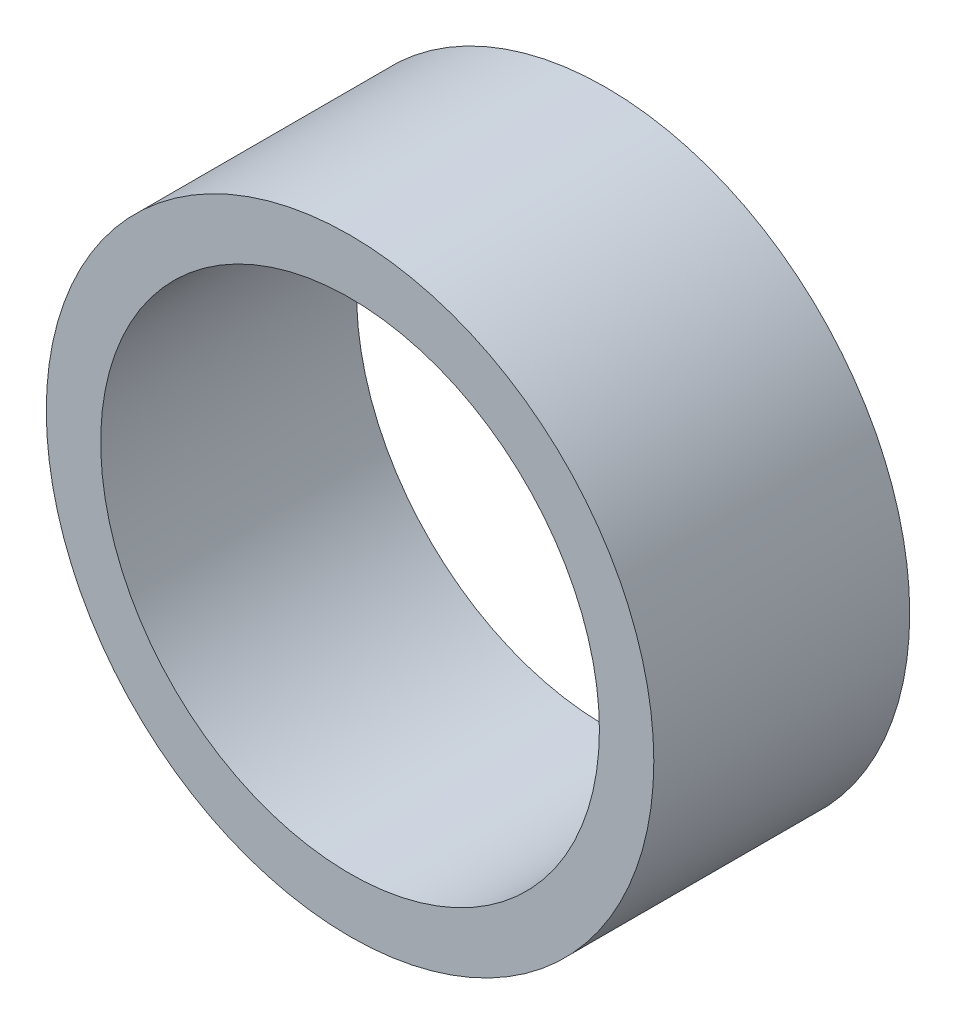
ISO-10303-21;
HEADER;
FILE_DESCRIPTION(('STEP AP214'),'2;1');
FILE_NAME('part.step','',(''),(''),'','','');
FILE_SCHEMA(('AUTOMOTIVE_DESIGN { 1 0 10303 214 1 1 1 1 }'));
ENDSEC;
DATA;
#1=APPLICATION_CONTEXT('core data for automotive mechanical design processes');
#2=APPLICATION_PROTOCOL_DEFINITION('international standard','automotive_design',2000,#1);
#3=PRODUCT_CONTEXT('',#1,'mechanical');
#4=PRODUCT('Part','Part','',(#3));
#5=PRODUCT_RELATED_PRODUCT_CATEGORY('part','',(#4));
#6=PRODUCT_DEFINITION_FORMATION('','',#4);
#7=PRODUCT_DEFINITION_CONTEXT('part definition',#1,'design');
#8=PRODUCT_DEFINITION('design','',#6,#7);
#9=PRODUCT_DEFINITION_SHAPE('','',#8);
#10=(LENGTH_UNIT() NAMED_UNIT(*) SI_UNIT(.MILLI.,.METRE.));
#11=(NAMED_UNIT(*) PLANE_ANGLE_UNIT() SI_UNIT($,.RADIAN.));
#12=(NAMED_UNIT(*) SI_UNIT($,.STERADIAN.) SOLID_ANGLE_UNIT());
#13=UNCERTAINTY_MEASURE_WITH_UNIT(LENGTH_MEASURE(1.E-05),#10,'distance_accuracy_value','');
#14=(GEOMETRIC_REPRESENTATION_CONTEXT(3) GLOBAL_UNCERTAINTY_ASSIGNED_CONTEXT((#13)) GLOBAL_UNIT_ASSIGNED_CONTEXT((#10,
#11,#12)) REPRESENTATION_CONTEXT('',''));
#15=CARTESIAN_POINT('',(0.,0.,0.));
#16=DIRECTION('',(0.,0.,1.));
#17=DIRECTION('',(1.,0.,0.));
#18=AXIS2_PLACEMENT_3D('',#15,#16,#17);
#19=CARTESIAN_POINT('',(0.,0.,12.7));
#20=DIRECTION('',(0.,0.,1.));
#21=DIRECTION('',(1.,0.,0.));
#22=AXIS2_PLACEMENT_3D('',#19,#20,#21);
#23=PLANE('',#22);
#24=CARTESIAN_POINT('',(0.,0.,12.7));
#25=DIRECTION('',(0.,0.,1.));
#26=DIRECTION('',(1.,0.,0.));
#27=AXIS2_PLACEMENT_3D('',#24,#25,#26);
#28=CIRCLE('',#27,30.15);
#29=CARTESIAN_POINT('',(30.15,0.,12.7));
#30=VERTEX_POINT('',#29);
#31=EDGE_CURVE('E10',#30,#30,#28,.T.);
#32=ORIENTED_EDGE('',*,*,#31,.T.);
#33=EDGE_LOOP('',(#32));
#34=FACE_BOUND('',#33,.T.);
#35=CARTESIAN_POINT('',(0.,0.,12.7));
#36=DIRECTION('',(0.,0.,1.));
#37=DIRECTION('',(1.,0.,0.));
#38=AXIS2_PLACEMENT_3D('',#35,#36,#37);
#39=CIRCLE('',#38,24.75);
#40=CARTESIAN_POINT('',(24.75,0.,12.7));
#41=VERTEX_POINT('',#40);
#42=EDGE_CURVE('E48',#41,#41,#39,.T.);
#43=ORIENTED_EDGE('',*,*,#42,.F.);
#44=EDGE_LOOP('',(#43));
#45=FACE_BOUND('',#44,.T.);
#46=ADVANCED_FACE('F37',(#34,#45),#23,.T.);
#47=CARTESIAN_POINT('',(0.,0.,-12.7));
#48=DIRECTION('',(0.,0.,1.));
#49=DIRECTION('',(1.,0.,0.));
#50=AXIS2_PLACEMENT_3D('',#47,#48,#49);
#51=PLANE('',#50);
#52=CARTESIAN_POINT('',(0.,0.,-12.7));
#53=DIRECTION('',(0.,0.,1.));
#54=DIRECTION('',(1.,0.,0.));
#55=AXIS2_PLACEMENT_3D('',#52,#53,#54);
#56=CIRCLE('',#55,30.15);
#57=CARTESIAN_POINT('',(30.15,0.,-12.7));
#58=VERTEX_POINT('',#57);
#59=EDGE_CURVE('E41',#58,#58,#56,.T.);
#60=ORIENTED_EDGE('',*,*,#59,.F.);
#61=EDGE_LOOP('',(#60));
#62=FACE_BOUND('',#61,.T.);
#63=CARTESIAN_POINT('',(0.,0.,-12.7));
#64=DIRECTION('',(0.,0.,1.));
#65=DIRECTION('',(1.,0.,0.));
#66=AXIS2_PLACEMENT_3D('',#63,#64,#65);
#67=CIRCLE('',#66,24.75);
#68=CARTESIAN_POINT('',(24.75,0.,-12.7));
#69=VERTEX_POINT('',#68);
#70=EDGE_CURVE('E50',#69,#69,#67,.T.);
#71=ORIENTED_EDGE('',*,*,#70,.T.);
#72=EDGE_LOOP('',(#71));
#73=FACE_BOUND('',#72,.T.);
#74=ADVANCED_FACE('F60',(#62,#73),#51,.F.);
#75=CARTESIAN_POINT('',(0.,0.,12.7));
#76=DIRECTION('',(0.,0.,-1.));
#77=DIRECTION('',(-1.,0.,0.));
#78=AXIS2_PLACEMENT_3D('',#75,#76,#77);
#79=CYLINDRICAL_SURFACE('',#78,30.15);
#80=ORIENTED_EDGE('',*,*,#31,.F.);
#81=EDGE_LOOP('',(#80));
#82=FACE_BOUND('',#81,.T.);
#83=ORIENTED_EDGE('',*,*,#59,.T.);
#84=EDGE_LOOP('',(#83));
#85=FACE_BOUND('',#84,.T.);
#86=ADVANCED_FACE('F39',(#82,#85),#79,.T.);
#87=CARTESIAN_POINT('',(0.,0.,12.7));
#88=DIRECTION('',(0.,0.,-1.));
#89=DIRECTION('',(-1.,0.,0.));
#90=AXIS2_PLACEMENT_3D('',#87,#88,#89);
#91=CYLINDRICAL_SURFACE('',#90,24.75);
#92=ORIENTED_EDGE('',*,*,#42,.T.);
#93=EDGE_LOOP('',(#92));
#94=FACE_BOUND('',#93,.T.);
#95=ORIENTED_EDGE('',*,*,#70,.F.);
#96=EDGE_LOOP('',(#95));
#97=FACE_BOUND('',#96,.T.);
#98=ADVANCED_FACE('F56',(#94,#97),#91,.F.);
#99=CLOSED_SHELL('',(#46,#74,#86,#98));
#100=MANIFOLD_SOLID_BREP('B2',#99);
#101=ADVANCED_BREP_SHAPE_REPRESENTATION('',(#18,#100),#14);
#102=SHAPE_DEFINITION_REPRESENTATION(#9,#101);
ENDSEC;
END-ISO-10303-21;
